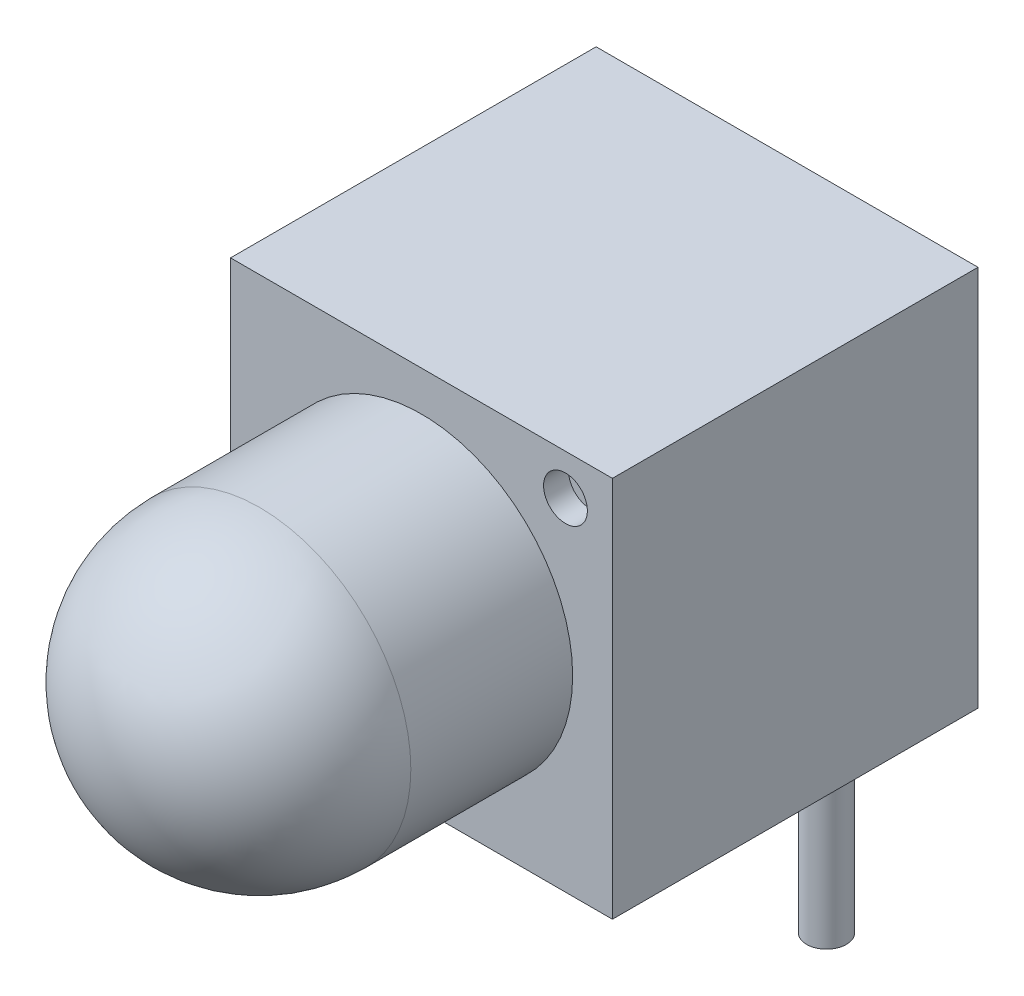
from build123d import *

# Parameters (mm, degrees)
SKETCH_1_W          = 6.1
SKETCH_1_H          = 5.84
EXTRUDE_1_DEPTH     = 6.1
SKETCH_3_R          = 0.3175
EXTRUDE_2_DEPTH     = 3.68
SKETCH_4_R          = 0.35
CUT_EXTRUDE_3_DEPTH = 0.4


with BuildPart() as part:
    # Sketch 1 → Extrude 1 (new body)
    with BuildSketch(Plane(origin=(0, 0, 0), x_dir=(1, 0, 0), z_dir=(0, 1, 0))):
        with Locations((0, 2.92)):
            Rectangle(SKETCH_1_W, SKETCH_1_H)
    extrude(amount=EXTRUDE_1_DEPTH)

    # Sketch 2 → Revolve 1 (revolve)
    with BuildSketch(Plane(origin=(0, 0, 0), x_dir=(0, 0, -1), z_dir=(1, 0, 0)), mode=Mode.PRIVATE) as revolve_1_sk:
        with BuildLine():
            Line((0, 5.465), (-2.585, 5.465))
            ThreePointArc((-2.585, 5.465), (-4.292662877, 4.757662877), (-5, 3.05))
            Line((-5, 3.05), (0, 3.05))
            Line((0, 3.05), (0, 5.465))
        make_face()
    revolve(revolve_1_sk.sketch.rotate(Axis((0, 3.05, 5), (0, 0, -1)), 90), axis=Axis((0, 3.05, 5), (0, 0, -1)))

    # Sketch 3 → Extrude 2 (add)
    with BuildSketch(Plane.XZ):
        with Locations(Location((-1.27, -5.2, 0), (0, 0, 270))):
            Circle(SKETCH_3_R)
        with Locations(Location((1.27, -5.2, 0), (0, 0, 90))):
            Circle(SKETCH_3_R)
    extrude(amount=EXTRUDE_2_DEPTH)

    # Sketch 4 → Cut-Extrude 3 (cut)
    with BuildSketch(Plane.XY):
        with Locations((2.3, 5.45)):
            Circle(SKETCH_4_R)
    extrude(amount=-CUT_EXTRUDE_3_DEPTH, mode=Mode.SUBTRACT)


solid = part.part
